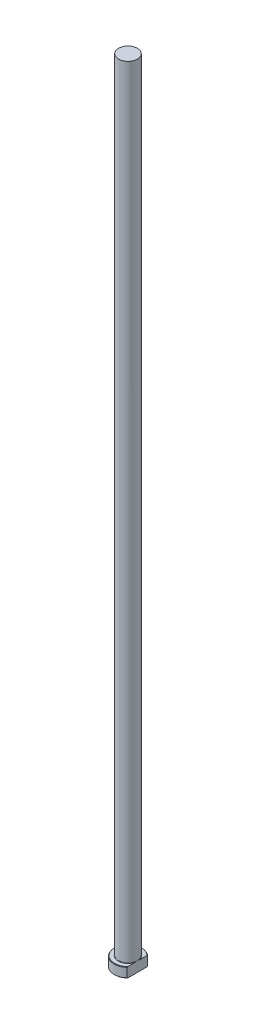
from build123d import *
from build123d.topology import SkipClean

# Parameters (mm, degrees)
CHAMFER1_SIZE = 0.2
FILLET1_R     = 0.2
KEY_DEPTH     = 401.122481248


with BuildPart() as part:
    # Sketch1 → Revolve1 (revolve)
    with BuildSketch(Plane.XY, mode=Mode.PRIVATE) as revolve1_sk:
        Polygon((0, 0), (-7, 0), (-7, 5), (-4.75, 5), (-4.75, 400), (0, 400), align=None)
    revolve(revolve1_sk.sketch.rotate(Axis((0, 259.958771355, 0), (0, -1, 0)), 270), axis=Axis((0, 259.958771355, 0), (0, -1, 0)))

    # Chamfer1
    chamfer1_edges = [part.edges().sort_by_distance(p)[0] for p in [
        (0, 5, -7),
        (0, 0, -7),
    ]]
    chamfer(chamfer1_edges, length=CHAMFER1_SIZE)

    # Fillet1
    fillet1_edges = [part.edges().sort_by_distance(p)[0] for p in [
        (0, 5, -4.75),
    ]]
    fillet(fillet1_edges, radius=FILLET1_R)

    # Sketch2 → KEY (cut, through all)
    with SkipClean():  # the faces are left unmerged after this step: merging them gives an invalid solid
        with BuildSketch(Plane(origin=(0, 0, 0), x_dir=(1, 0, 0), z_dir=(0, 1, 0))):
            with BuildLine():
                Line((4.75, 5.14174095), (4.75, -5.14174095))
                ThreePointArc((4.75, -5.14174095), (7, 0), (4.75, 5.14174095))
            make_face()
        extrude(amount=KEY_DEPTH, mode=Mode.SUBTRACT)


solid = part.part
